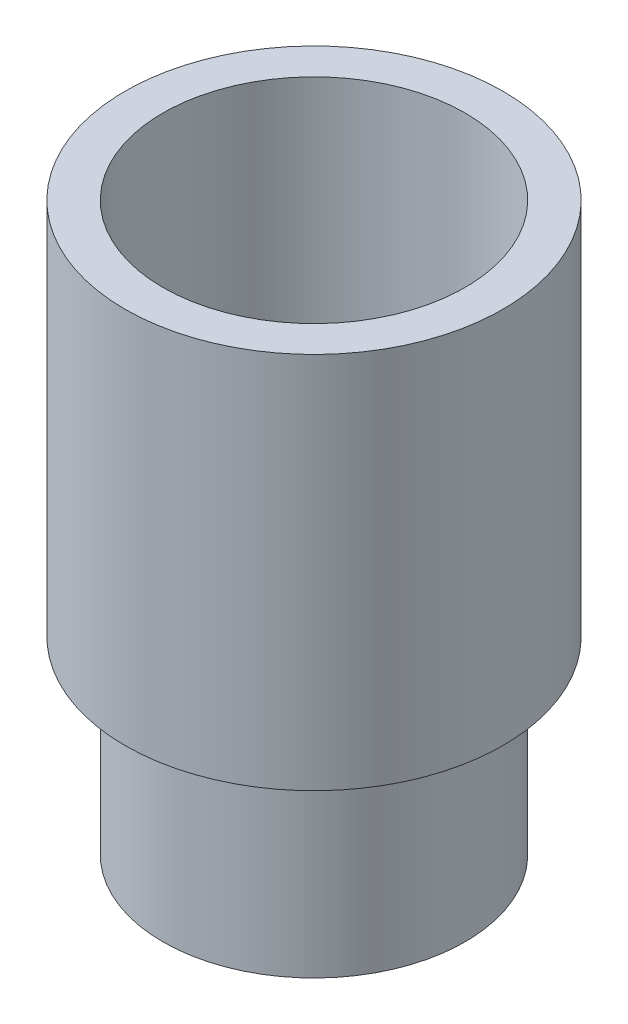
ISO-10303-21;
HEADER;
FILE_DESCRIPTION(('STEP AP214'),'2;1');
FILE_NAME('part.step','',(''),(''),'','','');
FILE_SCHEMA(('AUTOMOTIVE_DESIGN { 1 0 10303 214 1 1 1 1 }'));
ENDSEC;
DATA;
#1=APPLICATION_CONTEXT('core data for automotive mechanical design processes');
#2=APPLICATION_PROTOCOL_DEFINITION('international standard','automotive_design',2000,#1);
#3=PRODUCT_CONTEXT('',#1,'mechanical');
#4=PRODUCT('Part','Part','',(#3));
#5=PRODUCT_RELATED_PRODUCT_CATEGORY('part','',(#4));
#6=PRODUCT_DEFINITION_FORMATION('','',#4);
#7=PRODUCT_DEFINITION_CONTEXT('part definition',#1,'design');
#8=PRODUCT_DEFINITION('design','',#6,#7);
#9=PRODUCT_DEFINITION_SHAPE('','',#8);
#10=(LENGTH_UNIT() NAMED_UNIT(*) SI_UNIT(.MILLI.,.METRE.));
#11=(NAMED_UNIT(*) PLANE_ANGLE_UNIT() SI_UNIT($,.RADIAN.));
#12=(NAMED_UNIT(*) SI_UNIT($,.STERADIAN.) SOLID_ANGLE_UNIT());
#13=UNCERTAINTY_MEASURE_WITH_UNIT(LENGTH_MEASURE(1.E-05),#10,'distance_accuracy_value','');
#14=(GEOMETRIC_REPRESENTATION_CONTEXT(3) GLOBAL_UNCERTAINTY_ASSIGNED_CONTEXT((#13)) GLOBAL_UNIT_ASSIGNED_CONTEXT((#10,
#11,#12)) REPRESENTATION_CONTEXT('',''));
#15=CARTESIAN_POINT('',(0.,0.,0.));
#16=DIRECTION('',(0.,0.,1.));
#17=DIRECTION('',(1.,0.,0.));
#18=AXIS2_PLACEMENT_3D('',#15,#16,#17);
#19=CARTESIAN_POINT('',(0.,3.,0.));
#20=DIRECTION('',(0.,-1.,0.));
#21=DIRECTION('',(0.,0.,-1.));
#22=AXIS2_PLACEMENT_3D('',#19,#20,#21);
#23=CYLINDRICAL_SURFACE('',#22,4.);
#24=CARTESIAN_POINT('',(0.,3.,0.));
#25=DIRECTION('',(0.,-1.,0.));
#26=DIRECTION('',(0.,0.,-1.));
#27=AXIS2_PLACEMENT_3D('',#24,#25,#26);
#28=CIRCLE('',#27,4.);
#29=CARTESIAN_POINT('',(0.,3.,-4.));
#30=VERTEX_POINT('',#29);
#31=EDGE_CURVE('E11',#30,#30,#28,.T.);
#32=ORIENTED_EDGE('',*,*,#31,.T.);
#33=EDGE_LOOP('',(#32));
#34=FACE_BOUND('',#33,.T.);
#35=CARTESIAN_POINT('',(0.,-5.,0.));
#36=DIRECTION('',(0.,-1.,0.));
#37=DIRECTION('',(0.,0.,-1.));
#38=AXIS2_PLACEMENT_3D('',#35,#36,#37);
#39=CIRCLE('',#38,4.);
#40=CARTESIAN_POINT('',(0.,-5.,-4.));
#41=VERTEX_POINT('',#40);
#42=EDGE_CURVE('E58',#41,#41,#39,.T.);
#43=ORIENTED_EDGE('',*,*,#42,.F.);
#44=EDGE_LOOP('',(#43));
#45=FACE_BOUND('',#44,.T.);
#46=ADVANCED_FACE('F48',(#34,#45),#23,.T.);
#47=CARTESIAN_POINT('',(0.,3.,0.));
#48=DIRECTION('',(0.,-1.,0.));
#49=DIRECTION('',(0.,0.,-1.));
#50=AXIS2_PLACEMENT_3D('',#47,#48,#49);
#51=PLANE('',#50);
#52=CARTESIAN_POINT('',(0.,3.,0.));
#53=DIRECTION('',(0.,-1.,0.));
#54=DIRECTION('',(0.,0.,-1.));
#55=AXIS2_PLACEMENT_3D('',#52,#53,#54);
#56=CIRCLE('',#55,3.);
#57=CARTESIAN_POINT('',(0.,3.,-3.));
#58=VERTEX_POINT('',#57);
#59=EDGE_CURVE('E54',#58,#58,#56,.T.);
#60=ORIENTED_EDGE('',*,*,#59,.T.);
#61=EDGE_LOOP('',(#60));
#62=FACE_BOUND('',#61,.T.);
#63=ORIENTED_EDGE('',*,*,#31,.F.);
#64=EDGE_LOOP('',(#63));
#65=FACE_BOUND('',#64,.T.);
#66=ADVANCED_FACE('F77',(#62,#65),#51,.F.);
#67=CARTESIAN_POINT('',(0.,3.,0.));
#68=DIRECTION('',(0.,-1.,0.));
#69=DIRECTION('',(0.,0.,-1.));
#70=AXIS2_PLACEMENT_3D('',#67,#68,#69);
#71=CYLINDRICAL_SURFACE('',#70,3.);
#72=ORIENTED_EDGE('',*,*,#59,.F.);
#73=EDGE_LOOP('',(#72));
#74=FACE_BOUND('',#73,.T.);
#75=CARTESIAN_POINT('',(0.,-5.,0.));
#76=DIRECTION('',(0.,-1.,0.));
#77=DIRECTION('',(0.,0.,-1.));
#78=AXIS2_PLACEMENT_3D('',#75,#76,#77);
#79=CIRCLE('',#78,3.);
#80=CARTESIAN_POINT('',(0.,-5.,-3.));
#81=VERTEX_POINT('',#80);
#82=EDGE_CURVE('E62',#81,#81,#79,.T.);
#83=ORIENTED_EDGE('',*,*,#82,.T.);
#84=EDGE_LOOP('',(#83));
#85=FACE_BOUND('',#84,.T.);
#86=ADVANCED_FACE('F68',(#74,#85),#71,.F.);
#87=CARTESIAN_POINT('',(0.,-5.,0.));
#88=DIRECTION('',(0.,-1.,0.));
#89=DIRECTION('',(0.,0.,-1.));
#90=AXIS2_PLACEMENT_3D('',#87,#88,#89);
#91=PLANE('',#90);
#92=ORIENTED_EDGE('',*,*,#42,.T.);
#93=EDGE_LOOP('',(#92));
#94=FACE_BOUND('',#93,.T.);
#95=ORIENTED_EDGE('',*,*,#82,.F.);
#96=EDGE_LOOP('',(#95));
#97=FACE_BOUND('',#96,.T.);
#98=ADVANCED_FACE('F70',(#94,#97),#91,.T.);
#99=CLOSED_SHELL('',(#46,#66,#86,#98));
#100=MANIFOLD_SOLID_BREP('B2',#99);
#101=CARTESIAN_POINT('',(0.,10.,0.));
#102=DIRECTION('',(0.,1.,0.));
#103=DIRECTION('',(0.,0.,1.));
#104=AXIS2_PLACEMENT_3D('',#101,#102,#103);
#105=PLANE('',#104);
#106=CARTESIAN_POINT('',(0.,10.,0.));
#107=DIRECTION('',(0.,1.,0.));
#108=DIRECTION('',(0.,0.,1.));
#109=AXIS2_PLACEMENT_3D('',#106,#107,#108);
#110=CIRCLE('',#109,5.);
#111=CARTESIAN_POINT('',(0.,10.,5.));
#112=VERTEX_POINT('',#111);
#113=EDGE_CURVE('E47',#112,#112,#110,.T.);
#114=ORIENTED_EDGE('',*,*,#113,.T.);
#115=EDGE_LOOP('',(#114));
#116=FACE_BOUND('',#115,.T.);
#117=CARTESIAN_POINT('',(0.,10.,0.));
#118=DIRECTION('',(0.,1.,0.));
#119=DIRECTION('',(0.,0.,1.));
#120=AXIS2_PLACEMENT_3D('',#117,#118,#119);
#121=CIRCLE('',#120,4.);
#122=CARTESIAN_POINT('',(0.,10.,4.));
#123=VERTEX_POINT('',#122);
#124=EDGE_CURVE('E130',#123,#123,#121,.T.);
#125=ORIENTED_EDGE('',*,*,#124,.F.);
#126=EDGE_LOOP('',(#125));
#127=FACE_BOUND('',#126,.T.);
#128=ADVANCED_FACE('F117',(#116,#127),#105,.T.);
#129=CARTESIAN_POINT('',(0.,0.,0.));
#130=DIRECTION('',(0.,1.,0.));
#131=DIRECTION('',(0.,0.,1.));
#132=AXIS2_PLACEMENT_3D('',#129,#130,#131);
#133=PLANE('',#132);
#134=CARTESIAN_POINT('',(0.,0.,0.));
#135=DIRECTION('',(0.,1.,0.));
#136=DIRECTION('',(0.,0.,1.));
#137=AXIS2_PLACEMENT_3D('',#134,#135,#136);
#138=CIRCLE('',#137,5.);
#139=CARTESIAN_POINT('',(0.,0.,5.));
#140=VERTEX_POINT('',#139);
#141=EDGE_CURVE('E121',#140,#140,#138,.T.);
#142=ORIENTED_EDGE('',*,*,#141,.F.);
#143=EDGE_LOOP('',(#142));
#144=FACE_BOUND('',#143,.T.);
#145=CARTESIAN_POINT('',(0.,0.,0.));
#146=DIRECTION('',(0.,1.,0.));
#147=DIRECTION('',(0.,0.,1.));
#148=AXIS2_PLACEMENT_3D('',#145,#146,#147);
#149=CIRCLE('',#148,4.);
#150=CARTESIAN_POINT('',(0.,0.,4.));
#151=VERTEX_POINT('',#150);
#152=EDGE_CURVE('E132',#151,#151,#149,.T.);
#153=ORIENTED_EDGE('',*,*,#152,.T.);
#154=EDGE_LOOP('',(#153));
#155=FACE_BOUND('',#154,.T.);
#156=ADVANCED_FACE('F144',(#144,#155),#133,.F.);
#157=CARTESIAN_POINT('',(0.,10.,0.));
#158=DIRECTION('',(0.,-1.,0.));
#159=DIRECTION('',(0.,0.,-1.));
#160=AXIS2_PLACEMENT_3D('',#157,#158,#159);
#161=CYLINDRICAL_SURFACE('',#160,5.);
#162=ORIENTED_EDGE('',*,*,#113,.F.);
#163=EDGE_LOOP('',(#162));
#164=FACE_BOUND('',#163,.T.);
#165=ORIENTED_EDGE('',*,*,#141,.T.);
#166=EDGE_LOOP('',(#165));
#167=FACE_BOUND('',#166,.T.);
#168=ADVANCED_FACE('F119',(#164,#167),#161,.T.);
#169=CARTESIAN_POINT('',(0.,10.,0.));
#170=DIRECTION('',(0.,-1.,0.));
#171=DIRECTION('',(0.,0.,-1.));
#172=AXIS2_PLACEMENT_3D('',#169,#170,#171);
#173=CYLINDRICAL_SURFACE('',#172,4.);
#174=ORIENTED_EDGE('',*,*,#124,.T.);
#175=EDGE_LOOP('',(#174));
#176=FACE_BOUND('',#175,.T.);
#177=ORIENTED_EDGE('',*,*,#152,.F.);
#178=EDGE_LOOP('',(#177));
#179=FACE_BOUND('',#178,.T.);
#180=ADVANCED_FACE('F140',(#176,#179),#173,.F.);
#181=CLOSED_SHELL('',(#128,#156,#168,#180));
#182=MANIFOLD_SOLID_BREP('B6',#181);
#183=ADVANCED_BREP_SHAPE_REPRESENTATION('',(#18,#100,#182),#14);
#184=SHAPE_DEFINITION_REPRESENTATION(#9,#183);
ENDSEC;
END-ISO-10303-21;
